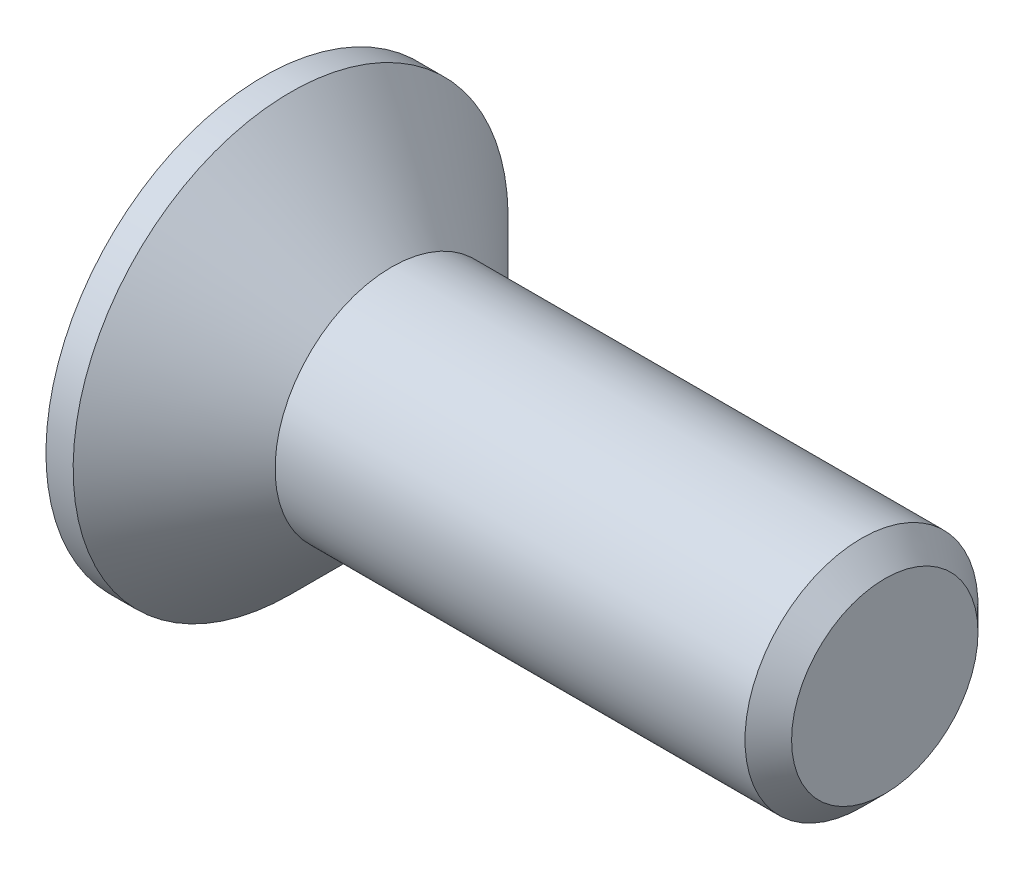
from build123d import *

# Parameters (mm, degrees)
CHAMFER1_SIZE      = 0.3
CUT_EXTRUDE1_DEPTH = 1.25


with BuildPart() as part:
    # Sketch1 → Revolve1 (revolve)
    with BuildSketch(Plane.XY, mode=Mode.PRIVATE) as revolve1_sk:
        Polygon((-1.65, 2.8), (-1.65, 0), (6.35, 0), (6.35, 1.5), (0, 1.5), (-1.3, 2.8), align=None)
    revolve(revolve1_sk.sketch.rotate(Axis((-1.65, 0, 0), (1, 0, 0)), 180), axis=Axis((-1.65, 0, 0), (1, 0, 0)))

    # Chamfer1
    chamfer1_edges = [part.edges().sort_by_distance(p)[0] for p in [
        (6.35, 1.5, 0),
    ]]
    chamfer(chamfer1_edges, length=CHAMFER1_SIZE)

    # Sketch2 → Cut-Extrude1 (cut)
    with BuildSketch(Plane.ZY.offset(1.65)):
        Polygon((-0.365, 1.45), (0.365, 1.45), (0.365, 0.365), (1.45, 0.365), (1.45, -0.365), (0.365, -0.365), (0.365, -1.45), (-0.365, -1.45), (-0.365, -0.365), (-1.45, -0.365), (-1.45, 0.365), (-0.365, 0.365), align=None)
    extrude(amount=-CUT_EXTRUDE1_DEPTH, mode=Mode.SUBTRACT)


solid = part.part
